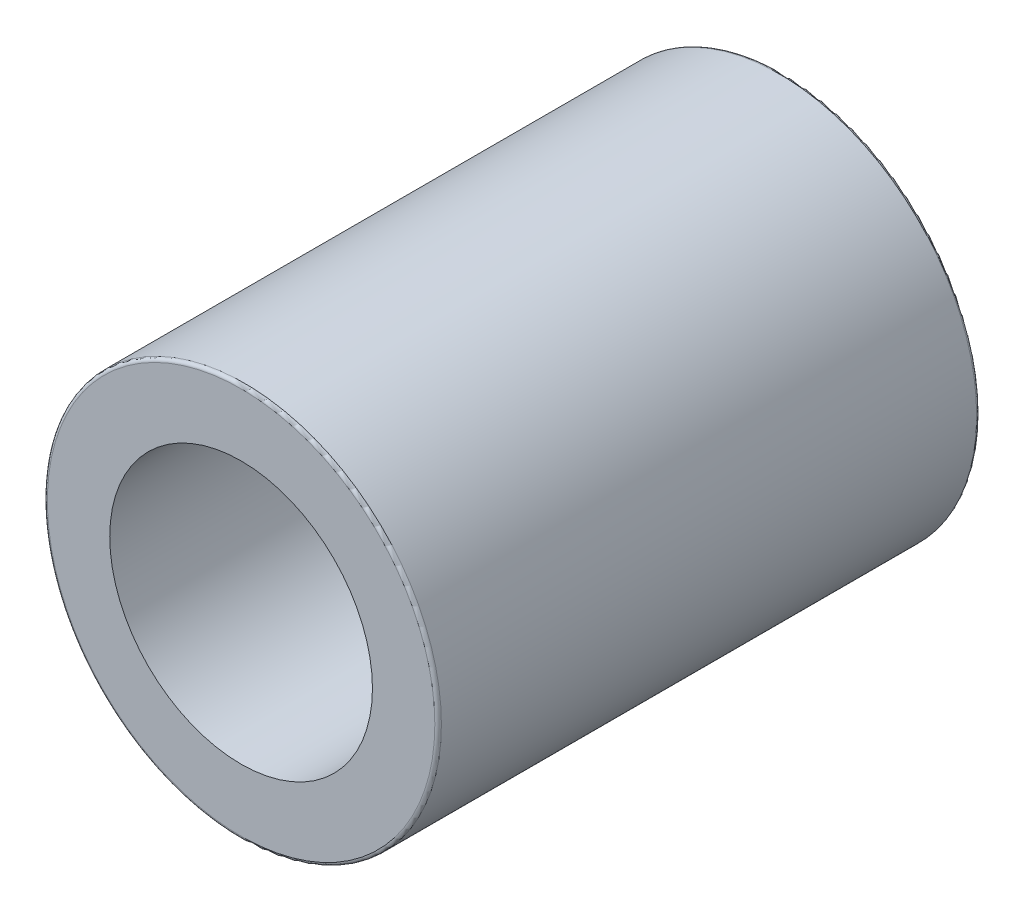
from build123d import *

# Parameters (mm, degrees)
SKETCH1_R           = 60
SKETCH1_R_2         = 40
BOSS_EXTRUDE1_DEPTH = 165
FILLET1_R           = 1


with BuildPart() as part:
    # Sketch1 → Boss-Extrude1 (new body)
    with BuildSketch(Plane.XY):
        Circle(SKETCH1_R)
        Circle(SKETCH1_R_2, mode=Mode.SUBTRACT)
    extrude(amount=BOSS_EXTRUDE1_DEPTH)

    # Fillet1
    fillet1_edges = [part.edges().sort_by_distance(p)[0] for p in [
        (-60, 0, 0),
        (-60, 0, 165),
    ]]
    fillet(fillet1_edges, radius=FILLET1_R)


solid = part.part
